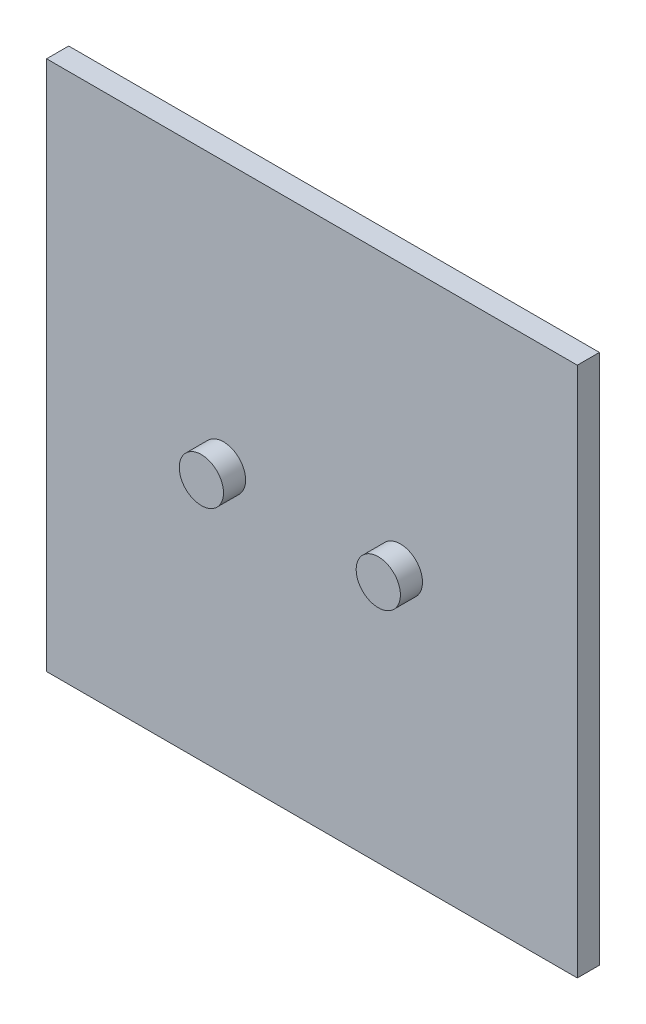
ISO-10303-21;
HEADER;
FILE_DESCRIPTION(('STEP AP214'),'2;1');
FILE_NAME('part.step','',(''),(''),'','','');
FILE_SCHEMA(('AUTOMOTIVE_DESIGN { 1 0 10303 214 1 1 1 1 }'));
ENDSEC;
DATA;
#1=APPLICATION_CONTEXT('core data for automotive mechanical design processes');
#2=APPLICATION_PROTOCOL_DEFINITION('international standard','automotive_design',2000,#1);
#3=PRODUCT_CONTEXT('',#1,'mechanical');
#4=PRODUCT('Part','Part','',(#3));
#5=PRODUCT_RELATED_PRODUCT_CATEGORY('part','',(#4));
#6=PRODUCT_DEFINITION_FORMATION('','',#4);
#7=PRODUCT_DEFINITION_CONTEXT('part definition',#1,'design');
#8=PRODUCT_DEFINITION('design','',#6,#7);
#9=PRODUCT_DEFINITION_SHAPE('','',#8);
#10=(LENGTH_UNIT() NAMED_UNIT(*) SI_UNIT(.MILLI.,.METRE.));
#11=(NAMED_UNIT(*) PLANE_ANGLE_UNIT() SI_UNIT($,.RADIAN.));
#12=(NAMED_UNIT(*) SI_UNIT($,.STERADIAN.) SOLID_ANGLE_UNIT());
#13=UNCERTAINTY_MEASURE_WITH_UNIT(LENGTH_MEASURE(1.E-05),#10,'distance_accuracy_value','');
#14=(GEOMETRIC_REPRESENTATION_CONTEXT(3) GLOBAL_UNCERTAINTY_ASSIGNED_CONTEXT((#13)) GLOBAL_UNIT_ASSIGNED_CONTEXT((#10,
#11,#12)) REPRESENTATION_CONTEXT('',''));
#15=CARTESIAN_POINT('',(0.,0.,0.));
#16=DIRECTION('',(0.,0.,1.));
#17=DIRECTION('',(1.,0.,0.));
#18=AXIS2_PLACEMENT_3D('',#15,#16,#17);
#19=CARTESIAN_POINT('',(0.,76.2,3.175));
#20=DIRECTION('',(0.,0.,-1.));
#21=DIRECTION('',(-1.,0.,0.));
#22=AXIS2_PLACEMENT_3D('',#19,#20,#21);
#23=PLANE('',#22);
#24=CARTESIAN_POINT('',(25.4,38.1,3.175));
#25=DIRECTION('',(0.,0.,-1.));
#26=DIRECTION('',(-1.,0.,0.));
#27=AXIS2_PLACEMENT_3D('',#24,#25,#26);
#28=CIRCLE('',#27,3.175);
#29=CARTESIAN_POINT('',(22.225,38.1,3.175));
#30=VERTEX_POINT('',#29);
#31=EDGE_CURVE('E40',#30,#30,#28,.F.);
#32=ORIENTED_EDGE('',*,*,#31,.F.);
#33=EDGE_LOOP('',(#32));
#34=FACE_BOUND('',#33,.T.);
#35=DIRECTION('',(0.,-1.,0.));
#36=VECTOR('',#35,1.);
#37=CARTESIAN_POINT('',(0.,0.,3.175));
#38=LINE('',#37,#36);
#39=CARTESIAN_POINT('',(0.,76.2,3.175));
#40=VERTEX_POINT('',#39);
#41=CARTESIAN_POINT('',(0.,0.,3.175));
#42=VERTEX_POINT('',#41);
#43=EDGE_CURVE('E84',#40,#42,#38,.T.);
#44=ORIENTED_EDGE('',*,*,#43,.T.);
#45=DIRECTION('',(1.,0.,0.));
#46=VECTOR('',#45,1.);
#47=CARTESIAN_POINT('',(0.,0.,3.175));
#48=LINE('',#47,#46);
#49=CARTESIAN_POINT('',(76.2,0.,3.175));
#50=VERTEX_POINT('',#49);
#51=EDGE_CURVE('E79',#42,#50,#48,.T.);
#52=ORIENTED_EDGE('',*,*,#51,.T.);
#53=DIRECTION('',(0.,1.,0.));
#54=VECTOR('',#53,1.);
#55=CARTESIAN_POINT('',(76.2,0.,3.175));
#56=LINE('',#55,#54);
#57=CARTESIAN_POINT('',(76.2,76.2,3.175));
#58=VERTEX_POINT('',#57);
#59=EDGE_CURVE('E82',#50,#58,#56,.T.);
#60=ORIENTED_EDGE('',*,*,#59,.T.);
#61=DIRECTION('',(-1.,0.,0.));
#62=VECTOR('',#61,1.);
#63=CARTESIAN_POINT('',(0.,76.2,3.175));
#64=LINE('',#63,#62);
#65=EDGE_CURVE('E48',#58,#40,#64,.T.);
#66=ORIENTED_EDGE('',*,*,#65,.T.);
#67=EDGE_LOOP('',(#44,#52,#60,#66));
#68=FACE_BOUND('',#67,.T.);
#69=CARTESIAN_POINT('',(50.8,38.1,3.175));
#70=DIRECTION('',(0.,0.,-1.));
#71=DIRECTION('',(-1.,0.,0.));
#72=AXIS2_PLACEMENT_3D('',#69,#70,#71);
#73=CIRCLE('',#72,3.175);
#74=CARTESIAN_POINT('',(47.625,38.1,3.175));
#75=VERTEX_POINT('',#74);
#76=EDGE_CURVE('E11',#75,#75,#73,.F.);
#77=ORIENTED_EDGE('',*,*,#76,.F.);
#78=EDGE_LOOP('',(#77));
#79=FACE_BOUND('',#78,.T.);
#80=ADVANCED_FACE('F31',(#34,#68,#79),#23,.F.);
#81=CARTESIAN_POINT('',(0.,0.,3.175));
#82=DIRECTION('',(1.,0.,0.));
#83=DIRECTION('',(0.,0.,-1.));
#84=AXIS2_PLACEMENT_3D('',#81,#82,#83);
#85=PLANE('',#84);
#86=DIRECTION('',(0.,-1.,0.));
#87=VECTOR('',#86,1.);
#88=CARTESIAN_POINT('',(0.,0.,0.));
#89=LINE('',#88,#87);
#90=CARTESIAN_POINT('',(0.,76.2,0.));
#91=VERTEX_POINT('',#90);
#92=CARTESIAN_POINT('',(0.,0.,0.));
#93=VERTEX_POINT('',#92);
#94=EDGE_CURVE('E99',#91,#93,#89,.T.);
#95=ORIENTED_EDGE('',*,*,#94,.T.);
#96=DIRECTION('',(0.,0.,-1.));
#97=VECTOR('',#96,1.);
#98=CARTESIAN_POINT('',(0.,0.,3.175));
#99=LINE('',#98,#97);
#100=EDGE_CURVE('E90',#42,#93,#99,.T.);
#101=ORIENTED_EDGE('',*,*,#100,.F.);
#102=ORIENTED_EDGE('',*,*,#43,.F.);
#103=DIRECTION('',(0.,0.,-1.));
#104=VECTOR('',#103,1.);
#105=CARTESIAN_POINT('',(0.,76.2,3.175));
#106=LINE('',#105,#104);
#107=EDGE_CURVE('E95',#40,#91,#106,.T.);
#108=ORIENTED_EDGE('',*,*,#107,.T.);
#109=EDGE_LOOP('',(#95,#101,#102,#108));
#110=FACE_BOUND('',#109,.T.);
#111=ADVANCED_FACE('F33',(#110),#85,.F.);
#112=CARTESIAN_POINT('',(0.,0.,3.175));
#113=DIRECTION('',(0.,1.,0.));
#114=DIRECTION('',(0.,0.,1.));
#115=AXIS2_PLACEMENT_3D('',#112,#113,#114);
#116=PLANE('',#115);
#117=DIRECTION('',(1.,0.,0.));
#118=VECTOR('',#117,1.);
#119=CARTESIAN_POINT('',(0.,0.,0.));
#120=LINE('',#119,#118);
#121=CARTESIAN_POINT('',(76.2,0.,0.));
#122=VERTEX_POINT('',#121);
#123=EDGE_CURVE('E89',#93,#122,#120,.T.);
#124=ORIENTED_EDGE('',*,*,#123,.T.);
#125=DIRECTION('',(0.,0.,-1.));
#126=VECTOR('',#125,1.);
#127=CARTESIAN_POINT('',(76.2,0.,3.175));
#128=LINE('',#127,#126);
#129=EDGE_CURVE('E87',#50,#122,#128,.T.);
#130=ORIENTED_EDGE('',*,*,#129,.F.);
#131=ORIENTED_EDGE('',*,*,#51,.F.);
#132=ORIENTED_EDGE('',*,*,#100,.T.);
#133=EDGE_LOOP('',(#124,#130,#131,#132));
#134=FACE_BOUND('',#133,.T.);
#135=ADVANCED_FACE('F88',(#134),#116,.F.);
#136=CARTESIAN_POINT('',(76.2,0.,3.175));
#137=DIRECTION('',(-1.,0.,0.));
#138=DIRECTION('',(0.,0.,1.));
#139=AXIS2_PLACEMENT_3D('',#136,#137,#138);
#140=PLANE('',#139);
#141=DIRECTION('',(0.,1.,0.));
#142=VECTOR('',#141,1.);
#143=CARTESIAN_POINT('',(76.2,0.,0.));
#144=LINE('',#143,#142);
#145=CARTESIAN_POINT('',(76.2,76.2,0.));
#146=VERTEX_POINT('',#145);
#147=EDGE_CURVE('E65',#122,#146,#144,.T.);
#148=ORIENTED_EDGE('',*,*,#147,.T.);
#149=DIRECTION('',(0.,0.,-1.));
#150=VECTOR('',#149,1.);
#151=CARTESIAN_POINT('',(76.2,76.2,3.175));
#152=LINE('',#151,#150);
#153=EDGE_CURVE('E91',#58,#146,#152,.T.);
#154=ORIENTED_EDGE('',*,*,#153,.F.);
#155=ORIENTED_EDGE('',*,*,#59,.F.);
#156=ORIENTED_EDGE('',*,*,#129,.T.);
#157=EDGE_LOOP('',(#148,#154,#155,#156));
#158=FACE_BOUND('',#157,.T.);
#159=ADVANCED_FACE('F93',(#158),#140,.F.);
#160=CARTESIAN_POINT('',(0.,76.2,3.175));
#161=DIRECTION('',(0.,-1.,0.));
#162=DIRECTION('',(0.,0.,-1.));
#163=AXIS2_PLACEMENT_3D('',#160,#161,#162);
#164=PLANE('',#163);
#165=DIRECTION('',(-1.,0.,0.));
#166=VECTOR('',#165,1.);
#167=CARTESIAN_POINT('',(0.,76.2,0.));
#168=LINE('',#167,#166);
#169=EDGE_CURVE('E71',#146,#91,#168,.T.);
#170=ORIENTED_EDGE('',*,*,#169,.T.);
#171=ORIENTED_EDGE('',*,*,#107,.F.);
#172=ORIENTED_EDGE('',*,*,#65,.F.);
#173=ORIENTED_EDGE('',*,*,#153,.T.);
#174=EDGE_LOOP('',(#170,#171,#172,#173));
#175=FACE_BOUND('',#174,.T.);
#176=ADVANCED_FACE('F125',(#175),#164,.F.);
#177=CARTESIAN_POINT('',(0.,76.2,0.));
#178=DIRECTION('',(0.,0.,-1.));
#179=DIRECTION('',(-1.,0.,0.));
#180=AXIS2_PLACEMENT_3D('',#177,#178,#179);
#181=PLANE('',#180);
#182=ORIENTED_EDGE('',*,*,#94,.F.);
#183=ORIENTED_EDGE('',*,*,#169,.F.);
#184=ORIENTED_EDGE('',*,*,#147,.F.);
#185=ORIENTED_EDGE('',*,*,#123,.F.);
#186=EDGE_LOOP('',(#182,#183,#184,#185));
#187=FACE_BOUND('',#186,.T.);
#188=ADVANCED_FACE('F122',(#187),#181,.T.);
#189=CARTESIAN_POINT('',(25.4,38.1,6.35));
#190=DIRECTION('',(0.,0.,-1.));
#191=DIRECTION('',(-1.,0.,0.));
#192=AXIS2_PLACEMENT_3D('',#189,#190,#191);
#193=CYLINDRICAL_SURFACE('',#192,3.175);
#194=CARTESIAN_POINT('',(25.4,38.1,6.35));
#195=DIRECTION('',(0.,0.,1.));
#196=DIRECTION('',(1.,0.,0.));
#197=AXIS2_PLACEMENT_3D('',#194,#195,#196);
#198=CIRCLE('',#197,3.175);
#199=CARTESIAN_POINT('',(28.575,38.1,6.35));
#200=VERTEX_POINT('',#199);
#201=EDGE_CURVE('E102',#200,#200,#198,.T.);
#202=ORIENTED_EDGE('',*,*,#201,.F.);
#203=EDGE_LOOP('',(#202));
#204=FACE_BOUND('',#203,.T.);
#205=ORIENTED_EDGE('',*,*,#31,.T.);
#206=EDGE_LOOP('',(#205));
#207=FACE_BOUND('',#206,.T.);
#208=ADVANCED_FACE('F111',(#204,#207),#193,.T.);
#209=CARTESIAN_POINT('',(25.4,38.1,6.35));
#210=DIRECTION('',(0.,0.,1.));
#211=DIRECTION('',(1.,0.,0.));
#212=AXIS2_PLACEMENT_3D('',#209,#210,#211);
#213=PLANE('',#212);
#214=ORIENTED_EDGE('',*,*,#201,.T.);
#215=EDGE_LOOP('',(#214));
#216=FACE_BOUND('',#215,.T.);
#217=ADVANCED_FACE('F153',(#216),#213,.T.);
#218=CARTESIAN_POINT('',(50.8,38.1,6.35));
#219=DIRECTION('',(0.,0.,-1.));
#220=DIRECTION('',(-1.,0.,0.));
#221=AXIS2_PLACEMENT_3D('',#218,#219,#220);
#222=CYLINDRICAL_SURFACE('',#221,3.175);
#223=CARTESIAN_POINT('',(50.8,38.1,6.35));
#224=DIRECTION('',(0.,0.,1.));
#225=DIRECTION('',(1.,0.,0.));
#226=AXIS2_PLACEMENT_3D('',#223,#224,#225);
#227=CIRCLE('',#226,3.175);
#228=CARTESIAN_POINT('',(53.975,38.1,6.35));
#229=VERTEX_POINT('',#228);
#230=EDGE_CURVE('E204',#229,#229,#227,.T.);
#231=ORIENTED_EDGE('',*,*,#230,.F.);
#232=EDGE_LOOP('',(#231));
#233=FACE_BOUND('',#232,.T.);
#234=ORIENTED_EDGE('',*,*,#76,.T.);
#235=EDGE_LOOP('',(#234));
#236=FACE_BOUND('',#235,.T.);
#237=ADVANCED_FACE('F160',(#233,#236),#222,.T.);
#238=CARTESIAN_POINT('',(50.8,38.1,6.35));
#239=DIRECTION('',(0.,0.,1.));
#240=DIRECTION('',(1.,0.,0.));
#241=AXIS2_PLACEMENT_3D('',#238,#239,#240);
#242=PLANE('',#241);
#243=ORIENTED_EDGE('',*,*,#230,.T.);
#244=EDGE_LOOP('',(#243));
#245=FACE_BOUND('',#244,.T.);
#246=ADVANCED_FACE('F167',(#245),#242,.T.);
#247=CLOSED_SHELL('',(#80,#111,#135,#159,#176,#188,#208,#217,#237,#246));
#248=MANIFOLD_SOLID_BREP('B2',#247);
#249=ADVANCED_BREP_SHAPE_REPRESENTATION('',(#18,#248),#14);
#250=SHAPE_DEFINITION_REPRESENTATION(#9,#249);
ENDSEC;
END-ISO-10303-21;
